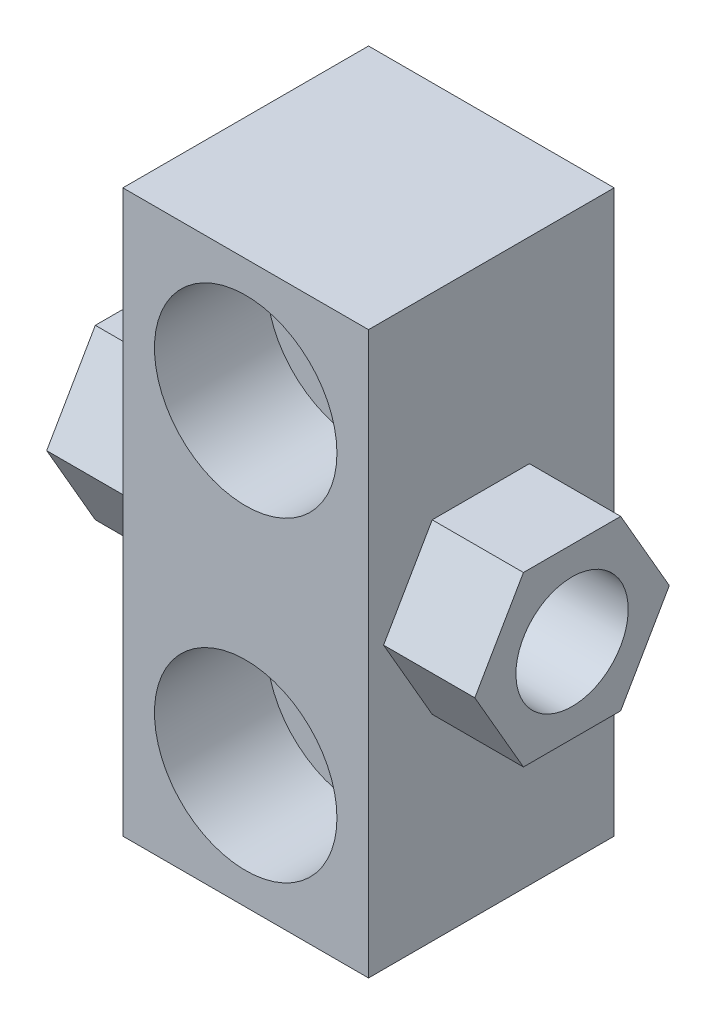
ISO-10303-21;
HEADER;
FILE_DESCRIPTION(('STEP AP214'),'2;1');
FILE_NAME('part.step','',(''),(''),'','','');
FILE_SCHEMA(('AUTOMOTIVE_DESIGN { 1 0 10303 214 1 1 1 1 }'));
ENDSEC;
DATA;
#1=APPLICATION_CONTEXT('core data for automotive mechanical design processes');
#2=APPLICATION_PROTOCOL_DEFINITION('international standard','automotive_design',2000,#1);
#3=PRODUCT_CONTEXT('',#1,'mechanical');
#4=PRODUCT('Part','Part','',(#3));
#5=PRODUCT_RELATED_PRODUCT_CATEGORY('part','',(#4));
#6=PRODUCT_DEFINITION_FORMATION('','',#4);
#7=PRODUCT_DEFINITION_CONTEXT('part definition',#1,'design');
#8=PRODUCT_DEFINITION('design','',#6,#7);
#9=PRODUCT_DEFINITION_SHAPE('','',#8);
#10=(LENGTH_UNIT() NAMED_UNIT(*) SI_UNIT(.MILLI.,.METRE.));
#11=(NAMED_UNIT(*) PLANE_ANGLE_UNIT() SI_UNIT($,.RADIAN.));
#12=(NAMED_UNIT(*) SI_UNIT($,.STERADIAN.) SOLID_ANGLE_UNIT());
#13=UNCERTAINTY_MEASURE_WITH_UNIT(LENGTH_MEASURE(1.E-05),#10,'distance_accuracy_value','');
#14=(GEOMETRIC_REPRESENTATION_CONTEXT(3) GLOBAL_UNCERTAINTY_ASSIGNED_CONTEXT((#13)) GLOBAL_UNIT_ASSIGNED_CONTEXT((#10,
#11,#12)) REPRESENTATION_CONTEXT('',''));
#15=CARTESIAN_POINT('',(0.,0.,0.));
#16=DIRECTION('',(0.,0.,1.));
#17=DIRECTION('',(1.,0.,0.));
#18=AXIS2_PLACEMENT_3D('',#15,#16,#17);
#19=CARTESIAN_POINT('',(0.,0.,36.5));
#20=DIRECTION('',(0.,0.,1.));
#21=DIRECTION('',(1.,0.,0.));
#22=AXIS2_PLACEMENT_3D('',#19,#20,#21);
#23=CYLINDRICAL_SURFACE('',#22,8.5);
#24=CARTESIAN_POINT('',(0.,0.,0.));
#25=DIRECTION('',(0.,0.,-1.));
#26=DIRECTION('',(-1.,0.,0.));
#27=AXIS2_PLACEMENT_3D('',#24,#25,#26);
#28=CIRCLE('',#27,8.5);
#29=CARTESIAN_POINT('',(-8.5,0.,0.));
#30=VERTEX_POINT('',#29);
#31=EDGE_CURVE('E288',#30,#30,#28,.T.);
#32=ORIENTED_EDGE('',*,*,#31,.T.);
#33=EDGE_LOOP('',(#32));
#34=FACE_BOUND('',#33,.T.);
#35=CARTESIAN_POINT('',(0.,0.,19.));
#36=DIRECTION('',(0.,0.,1.));
#37=DIRECTION('',(1.,0.,0.));
#38=AXIS2_PLACEMENT_3D('',#35,#36,#37);
#39=CIRCLE('',#38,8.5);
#40=CARTESIAN_POINT('',(8.5,0.,19.));
#41=VERTEX_POINT('',#40);
#42=EDGE_CURVE('E18',#41,#41,#39,.T.);
#43=ORIENTED_EDGE('',*,*,#42,.T.);
#44=EDGE_LOOP('',(#43));
#45=FACE_BOUND('',#44,.T.);
#46=ADVANCED_FACE('F14',(#34,#45),#23,.F.);
#47=CARTESIAN_POINT('',(0.,45.,36.5));
#48=DIRECTION('',(0.,0.,1.));
#49=DIRECTION('',(1.,0.,0.));
#50=AXIS2_PLACEMENT_3D('',#47,#48,#49);
#51=CYLINDRICAL_SURFACE('',#50,8.5);
#52=CARTESIAN_POINT('',(0.,45.,0.));
#53=DIRECTION('',(0.,0.,-1.));
#54=DIRECTION('',(-1.,0.,0.));
#55=AXIS2_PLACEMENT_3D('',#52,#53,#54);
#56=CIRCLE('',#55,8.5);
#57=CARTESIAN_POINT('',(-8.5,45.,0.));
#58=VERTEX_POINT('',#57);
#59=EDGE_CURVE('E285',#58,#58,#56,.T.);
#60=ORIENTED_EDGE('',*,*,#59,.T.);
#61=EDGE_LOOP('',(#60));
#62=FACE_BOUND('',#61,.T.);
#63=CARTESIAN_POINT('',(0.,45.,19.));
#64=DIRECTION('',(0.,0.,1.));
#65=DIRECTION('',(1.,0.,0.));
#66=AXIS2_PLACEMENT_3D('',#63,#64,#65);
#67=CIRCLE('',#66,8.5);
#68=CARTESIAN_POINT('',(8.5,45.,19.));
#69=VERTEX_POINT('',#68);
#70=EDGE_CURVE('E267',#69,#69,#67,.T.);
#71=ORIENTED_EDGE('',*,*,#70,.T.);
#72=EDGE_LOOP('',(#71));
#73=FACE_BOUND('',#72,.T.);
#74=ADVANCED_FACE('F310',(#62,#73),#51,.F.);
#75=CARTESIAN_POINT('',(-17.5,-17.5,1.5));
#76=DIRECTION('',(1.,0.,0.));
#77=DIRECTION('',(0.,1.,0.));
#78=AXIS2_PLACEMENT_3D('',#75,#76,#77);
#79=PLANE('',#78);
#80=DIRECTION('',(0.,0.866025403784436,0.5));
#81=VECTOR('',#80,1.);
#82=CARTESIAN_POINT('',(-17.5,10.5,25.9282032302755));
#83=LINE('',#82,#81);
#84=CARTESIAN_POINT('',(-17.5,10.5,25.9282032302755));
#85=VERTEX_POINT('',#84);
#86=CARTESIAN_POINT('',(-17.5,22.5,32.8564064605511));
#87=VERTEX_POINT('',#86);
#88=EDGE_CURVE('E39',#85,#87,#83,.T.);
#89=ORIENTED_EDGE('',*,*,#88,.F.);
#90=DIRECTION('',(0.,0.,-1.));
#91=VECTOR('',#90,1.);
#92=CARTESIAN_POINT('',(-17.5,10.5,25.9282032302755));
#93=LINE('',#92,#91);
#94=CARTESIAN_POINT('',(-17.5,10.5,12.0717967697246));
#95=VERTEX_POINT('',#94);
#96=EDGE_CURVE('E163',#85,#95,#93,.T.);
#97=ORIENTED_EDGE('',*,*,#96,.T.);
#98=DIRECTION('',(0.,0.866025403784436,-0.5));
#99=VECTOR('',#98,1.);
#100=CARTESIAN_POINT('',(-17.5,10.5,12.0717967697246));
#101=LINE('',#100,#99);
#102=CARTESIAN_POINT('',(-17.5,22.5,5.14359353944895));
#103=VERTEX_POINT('',#102);
#104=EDGE_CURVE('E166',#95,#103,#101,.T.);
#105=ORIENTED_EDGE('',*,*,#104,.T.);
#106=DIRECTION('',(0.,-0.866025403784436,-0.5));
#107=VECTOR('',#106,1.);
#108=CARTESIAN_POINT('',(-17.5,34.5,12.0717967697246));
#109=LINE('',#108,#107);
#110=CARTESIAN_POINT('',(-17.5,34.5,12.0717967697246));
#111=VERTEX_POINT('',#110);
#112=EDGE_CURVE('E169',#111,#103,#109,.T.);
#113=ORIENTED_EDGE('',*,*,#112,.F.);
#114=DIRECTION('',(0.,0.,-1.));
#115=VECTOR('',#114,1.);
#116=CARTESIAN_POINT('',(-17.5,34.5,25.9282032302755));
#117=LINE('',#116,#115);
#118=CARTESIAN_POINT('',(-17.5,34.5,25.9282032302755));
#119=VERTEX_POINT('',#118);
#120=EDGE_CURVE('E172',#119,#111,#117,.T.);
#121=ORIENTED_EDGE('',*,*,#120,.F.);
#122=DIRECTION('',(0.,-0.866025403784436,0.5));
#123=VECTOR('',#122,1.);
#124=CARTESIAN_POINT('',(-17.5,34.5,25.9282032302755));
#125=LINE('',#124,#123);
#126=EDGE_CURVE('E175',#119,#87,#125,.T.);
#127=ORIENTED_EDGE('',*,*,#126,.T.);
#128=EDGE_LOOP('',(#89,#97,#105,#113,#121,#127));
#129=FACE_BOUND('',#128,.T.);
#130=DIRECTION('',(0.,-1.,0.));
#131=VECTOR('',#130,1.);
#132=CARTESIAN_POINT('',(-17.5,62.5,35.));
#133=LINE('',#132,#131);
#134=CARTESIAN_POINT('',(-17.5,62.5,35.));
#135=VERTEX_POINT('',#134);
#136=CARTESIAN_POINT('',(-17.5,-17.5,35.));
#137=VERTEX_POINT('',#136);
#138=EDGE_CURVE('E127',#135,#137,#133,.T.);
#139=ORIENTED_EDGE('',*,*,#138,.F.);
#140=DIRECTION('',(0.,0.,1.));
#141=VECTOR('',#140,1.);
#142=CARTESIAN_POINT('',(-17.5,62.5,1.5));
#143=LINE('',#142,#141);
#144=CARTESIAN_POINT('',(-17.5,62.5,0.));
#145=VERTEX_POINT('',#144);
#146=EDGE_CURVE('E23',#145,#135,#143,.T.);
#147=ORIENTED_EDGE('',*,*,#146,.F.);
#148=DIRECTION('',(0.,1.,0.));
#149=VECTOR('',#148,1.);
#150=CARTESIAN_POINT('',(-17.5,-17.5,0.));
#151=LINE('',#150,#149);
#152=CARTESIAN_POINT('',(-17.5,-17.5,0.));
#153=VERTEX_POINT('',#152);
#154=EDGE_CURVE('E144',#153,#145,#151,.T.);
#155=ORIENTED_EDGE('',*,*,#154,.F.);
#156=DIRECTION('',(0.,0.,1.));
#157=VECTOR('',#156,1.);
#158=CARTESIAN_POINT('',(-17.5,-17.5,1.5));
#159=LINE('',#158,#157);
#160=EDGE_CURVE('E9',#153,#137,#159,.T.);
#161=ORIENTED_EDGE('',*,*,#160,.T.);
#162=EDGE_LOOP('',(#139,#147,#155,#161));
#163=FACE_BOUND('',#162,.T.);
#164=ADVANCED_FACE('F16',(#129,#163),#79,.F.);
#165=CARTESIAN_POINT('',(-17.5,-17.5,1.5));
#166=DIRECTION('',(0.,-1.,0.));
#167=DIRECTION('',(1.,0.,0.));
#168=AXIS2_PLACEMENT_3D('',#165,#166,#167);
#169=PLANE('',#168);
#170=DIRECTION('',(0.,0.,1.));
#171=VECTOR('',#170,1.);
#172=CARTESIAN_POINT('',(17.5,-17.5,1.5));
#173=LINE('',#172,#171);
#174=CARTESIAN_POINT('',(17.5,-17.5,0.));
#175=VERTEX_POINT('',#174);
#176=CARTESIAN_POINT('',(17.5,-17.5,35.));
#177=VERTEX_POINT('',#176);
#178=EDGE_CURVE('E139',#175,#177,#173,.T.);
#179=ORIENTED_EDGE('',*,*,#178,.T.);
#180=DIRECTION('',(1.,0.,0.));
#181=VECTOR('',#180,1.);
#182=CARTESIAN_POINT('',(-17.5,-17.5,35.));
#183=LINE('',#182,#181);
#184=EDGE_CURVE('E31',#137,#177,#183,.T.);
#185=ORIENTED_EDGE('',*,*,#184,.F.);
#186=ORIENTED_EDGE('',*,*,#160,.F.);
#187=DIRECTION('',(-1.,0.,0.));
#188=VECTOR('',#187,1.);
#189=CARTESIAN_POINT('',(17.5,-17.5,0.));
#190=LINE('',#189,#188);
#191=EDGE_CURVE('E149',#175,#153,#190,.T.);
#192=ORIENTED_EDGE('',*,*,#191,.F.);
#193=EDGE_LOOP('',(#179,#185,#186,#192));
#194=FACE_BOUND('',#193,.T.);
#195=ADVANCED_FACE('F136',(#194),#169,.T.);
#196=CARTESIAN_POINT('',(17.5,62.5,1.5));
#197=DIRECTION('',(0.,1.,0.));
#198=DIRECTION('',(-1.,0.,0.));
#199=AXIS2_PLACEMENT_3D('',#196,#197,#198);
#200=PLANE('',#199);
#201=ORIENTED_EDGE('',*,*,#146,.T.);
#202=DIRECTION('',(-1.,0.,0.));
#203=VECTOR('',#202,1.);
#204=CARTESIAN_POINT('',(17.5,62.5,35.));
#205=LINE('',#204,#203);
#206=CARTESIAN_POINT('',(17.5,62.5,35.));
#207=VERTEX_POINT('',#206);
#208=EDGE_CURVE('E130',#207,#135,#205,.T.);
#209=ORIENTED_EDGE('',*,*,#208,.F.);
#210=DIRECTION('',(0.,0.,1.));
#211=VECTOR('',#210,1.);
#212=CARTESIAN_POINT('',(17.5,62.5,1.5));
#213=LINE('',#212,#211);
#214=CARTESIAN_POINT('',(17.5,62.5,0.));
#215=VERTEX_POINT('',#214);
#216=EDGE_CURVE('E260',#215,#207,#213,.T.);
#217=ORIENTED_EDGE('',*,*,#216,.F.);
#218=DIRECTION('',(1.,0.,0.));
#219=VECTOR('',#218,1.);
#220=CARTESIAN_POINT('',(-17.5,62.5,0.));
#221=LINE('',#220,#219);
#222=EDGE_CURVE('E148',#145,#215,#221,.T.);
#223=ORIENTED_EDGE('',*,*,#222,.F.);
#224=EDGE_LOOP('',(#201,#209,#217,#223));
#225=FACE_BOUND('',#224,.T.);
#226=ADVANCED_FACE('F297',(#225),#200,.T.);
#227=CARTESIAN_POINT('',(17.5,62.5,1.5));
#228=DIRECTION('',(-1.,0.,0.));
#229=DIRECTION('',(0.,-1.,0.));
#230=AXIS2_PLACEMENT_3D('',#227,#228,#229);
#231=PLANE('',#230);
#232=DIRECTION('',(0.,0.,-1.));
#233=VECTOR('',#232,1.);
#234=CARTESIAN_POINT('',(17.5,10.5,25.9282032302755));
#235=LINE('',#234,#233);
#236=CARTESIAN_POINT('',(17.5,10.5,25.9282032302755));
#237=VERTEX_POINT('',#236);
#238=CARTESIAN_POINT('',(17.5,10.5,12.0717967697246));
#239=VERTEX_POINT('',#238);
#240=EDGE_CURVE('E220',#237,#239,#235,.T.);
#241=ORIENTED_EDGE('',*,*,#240,.F.);
#242=DIRECTION('',(0.,0.866025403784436,0.5));
#243=VECTOR('',#242,1.);
#244=CARTESIAN_POINT('',(17.5,10.5,25.9282032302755));
#245=LINE('',#244,#243);
#246=CARTESIAN_POINT('',(17.5,22.5,32.8564064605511));
#247=VERTEX_POINT('',#246);
#248=EDGE_CURVE('E208',#237,#247,#245,.T.);
#249=ORIENTED_EDGE('',*,*,#248,.T.);
#250=DIRECTION('',(0.,-0.866025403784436,0.5));
#251=VECTOR('',#250,1.);
#252=CARTESIAN_POINT('',(17.5,34.5,25.9282032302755));
#253=LINE('',#252,#251);
#254=CARTESIAN_POINT('',(17.5,34.5,25.9282032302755));
#255=VERTEX_POINT('',#254);
#256=EDGE_CURVE('E210',#255,#247,#253,.T.);
#257=ORIENTED_EDGE('',*,*,#256,.F.);
#258=DIRECTION('',(0.,0.,-1.));
#259=VECTOR('',#258,1.);
#260=CARTESIAN_POINT('',(17.5,34.5,25.9282032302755));
#261=LINE('',#260,#259);
#262=CARTESIAN_POINT('',(17.5,34.5,12.0717967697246));
#263=VERTEX_POINT('',#262);
#264=EDGE_CURVE('E213',#255,#263,#261,.T.);
#265=ORIENTED_EDGE('',*,*,#264,.T.);
#266=DIRECTION('',(0.,-0.866025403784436,-0.5));
#267=VECTOR('',#266,1.);
#268=CARTESIAN_POINT('',(17.5,34.5,12.0717967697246));
#269=LINE('',#268,#267);
#270=CARTESIAN_POINT('',(17.5,22.5,5.14359353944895));
#271=VERTEX_POINT('',#270);
#272=EDGE_CURVE('E215',#263,#271,#269,.T.);
#273=ORIENTED_EDGE('',*,*,#272,.T.);
#274=DIRECTION('',(0.,0.866025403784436,-0.5));
#275=VECTOR('',#274,1.);
#276=CARTESIAN_POINT('',(17.5,10.5,12.0717967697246));
#277=LINE('',#276,#275);
#278=EDGE_CURVE('E217',#239,#271,#277,.T.);
#279=ORIENTED_EDGE('',*,*,#278,.F.);
#280=EDGE_LOOP('',(#241,#249,#257,#265,#273,#279));
#281=FACE_BOUND('',#280,.T.);
#282=DIRECTION('',(0.,1.,0.));
#283=VECTOR('',#282,1.);
#284=CARTESIAN_POINT('',(17.5,-17.5,35.));
#285=LINE('',#284,#283);
#286=EDGE_CURVE('E140',#177,#207,#285,.T.);
#287=ORIENTED_EDGE('',*,*,#286,.F.);
#288=ORIENTED_EDGE('',*,*,#178,.F.);
#289=DIRECTION('',(0.,-1.,0.));
#290=VECTOR('',#289,1.);
#291=CARTESIAN_POINT('',(17.5,62.5,0.));
#292=LINE('',#291,#290);
#293=EDGE_CURVE('E153',#215,#175,#292,.T.);
#294=ORIENTED_EDGE('',*,*,#293,.F.);
#295=ORIENTED_EDGE('',*,*,#216,.T.);
#296=EDGE_LOOP('',(#287,#288,#294,#295));
#297=FACE_BOUND('',#296,.T.);
#298=ADVANCED_FACE('F295',(#281,#297),#231,.F.);
#299=CARTESIAN_POINT('',(0.,0.,36.5));
#300=DIRECTION('',(0.,0.,1.));
#301=DIRECTION('',(1.,0.,0.));
#302=AXIS2_PLACEMENT_3D('',#299,#300,#301);
#303=CYLINDRICAL_SURFACE('',#302,13.);
#304=CARTESIAN_POINT('',(0.,0.,35.));
#305=DIRECTION('',(0.,0.,1.));
#306=DIRECTION('',(1.,0.,0.));
#307=AXIS2_PLACEMENT_3D('',#304,#305,#306);
#308=CIRCLE('',#307,13.);
#309=CARTESIAN_POINT('',(13.,0.,35.));
#310=VERTEX_POINT('',#309);
#311=EDGE_CURVE('E266',#310,#310,#308,.T.);
#312=ORIENTED_EDGE('',*,*,#311,.T.);
#313=EDGE_LOOP('',(#312));
#314=FACE_BOUND('',#313,.T.);
#315=CARTESIAN_POINT('',(0.,0.,19.));
#316=DIRECTION('',(0.,0.,1.));
#317=DIRECTION('',(1.,0.,0.));
#318=AXIS2_PLACEMENT_3D('',#315,#316,#317);
#319=CIRCLE('',#318,13.);
#320=CARTESIAN_POINT('',(13.,0.,19.));
#321=VERTEX_POINT('',#320);
#322=EDGE_CURVE('E269',#321,#321,#319,.T.);
#323=ORIENTED_EDGE('',*,*,#322,.F.);
#324=EDGE_LOOP('',(#323));
#325=FACE_BOUND('',#324,.T.);
#326=ADVANCED_FACE('F305',(#314,#325),#303,.F.);
#327=CARTESIAN_POINT('',(0.,45.,36.5));
#328=DIRECTION('',(0.,0.,1.));
#329=DIRECTION('',(1.,0.,0.));
#330=AXIS2_PLACEMENT_3D('',#327,#328,#329);
#331=CYLINDRICAL_SURFACE('',#330,13.);
#332=CARTESIAN_POINT('',(0.,45.,35.));
#333=DIRECTION('',(0.,0.,1.));
#334=DIRECTION('',(1.,0.,0.));
#335=AXIS2_PLACEMENT_3D('',#332,#333,#334);
#336=CIRCLE('',#335,13.);
#337=CARTESIAN_POINT('',(13.,45.,35.));
#338=VERTEX_POINT('',#337);
#339=EDGE_CURVE('E264',#338,#338,#336,.T.);
#340=ORIENTED_EDGE('',*,*,#339,.T.);
#341=EDGE_LOOP('',(#340));
#342=FACE_BOUND('',#341,.T.);
#343=CARTESIAN_POINT('',(0.,45.,19.));
#344=DIRECTION('',(0.,0.,1.));
#345=DIRECTION('',(1.,0.,0.));
#346=AXIS2_PLACEMENT_3D('',#343,#344,#345);
#347=CIRCLE('',#346,13.);
#348=CARTESIAN_POINT('',(13.,45.,19.));
#349=VERTEX_POINT('',#348);
#350=EDGE_CURVE('E274',#349,#349,#347,.T.);
#351=ORIENTED_EDGE('',*,*,#350,.F.);
#352=EDGE_LOOP('',(#351));
#353=FACE_BOUND('',#352,.T.);
#354=ADVANCED_FACE('F322',(#342,#353),#331,.F.);
#355=CARTESIAN_POINT('',(30.5,10.5,25.9282032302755));
#356=DIRECTION('',(0.,-0.5,0.866025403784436));
#357=DIRECTION('',(0.,-0.866025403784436,-0.5));
#358=AXIS2_PLACEMENT_3D('',#355,#356,#357);
#359=PLANE('',#358);
#360=DIRECTION('',(-1.,0.,0.));
#361=VECTOR('',#360,1.);
#362=CARTESIAN_POINT('',(30.5,10.5,25.9282032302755));
#363=LINE('',#362,#361);
#364=CARTESIAN_POINT('',(30.5,10.5,25.9282032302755));
#365=VERTEX_POINT('',#364);
#366=EDGE_CURVE('E256',#365,#237,#363,.T.);
#367=ORIENTED_EDGE('',*,*,#366,.F.);
#368=DIRECTION('',(0.,0.866025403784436,0.5));
#369=VECTOR('',#368,1.);
#370=CARTESIAN_POINT('',(30.5,10.5,25.9282032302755));
#371=LINE('',#370,#369);
#372=CARTESIAN_POINT('',(30.5,22.5,32.8564064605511));
#373=VERTEX_POINT('',#372);
#374=EDGE_CURVE('E223',#365,#373,#371,.T.);
#375=ORIENTED_EDGE('',*,*,#374,.T.);
#376=DIRECTION('',(-1.,0.,0.));
#377=VECTOR('',#376,1.);
#378=CARTESIAN_POINT('',(30.5,22.5,32.8564064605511));
#379=LINE('',#378,#377);
#380=EDGE_CURVE('E241',#373,#247,#379,.T.);
#381=ORIENTED_EDGE('',*,*,#380,.T.);
#382=ORIENTED_EDGE('',*,*,#248,.F.);
#383=EDGE_LOOP('',(#367,#375,#381,#382));
#384=FACE_BOUND('',#383,.T.);
#385=ADVANCED_FACE('F327',(#384),#359,.T.);
#386=CARTESIAN_POINT('',(30.5,10.5,25.9282032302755));
#387=DIRECTION('',(0.,1.,0.));
#388=DIRECTION('',(-1.,0.,0.));
#389=AXIS2_PLACEMENT_3D('',#386,#387,#388);
#390=PLANE('',#389);
#391=DIRECTION('',(-1.,0.,0.));
#392=VECTOR('',#391,1.);
#393=CARTESIAN_POINT('',(30.5,10.5,12.0717967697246));
#394=LINE('',#393,#392);
#395=CARTESIAN_POINT('',(30.5,10.5,12.0717967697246));
#396=VERTEX_POINT('',#395);
#397=EDGE_CURVE('E253',#396,#239,#394,.T.);
#398=ORIENTED_EDGE('',*,*,#397,.F.);
#399=DIRECTION('',(0.,0.,-1.));
#400=VECTOR('',#399,1.);
#401=CARTESIAN_POINT('',(30.5,10.5,25.9282032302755));
#402=LINE('',#401,#400);
#403=EDGE_CURVE('E238',#365,#396,#402,.T.);
#404=ORIENTED_EDGE('',*,*,#403,.F.);
#405=ORIENTED_EDGE('',*,*,#366,.T.);
#406=ORIENTED_EDGE('',*,*,#240,.T.);
#407=EDGE_LOOP('',(#398,#404,#405,#406));
#408=FACE_BOUND('',#407,.T.);
#409=ADVANCED_FACE('F329',(#408),#390,.F.);
#410=CARTESIAN_POINT('',(30.5,10.5,12.0717967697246));
#411=DIRECTION('',(0.,0.5,0.866025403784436));
#412=DIRECTION('',(0.,-0.866025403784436,0.5));
#413=AXIS2_PLACEMENT_3D('',#410,#411,#412);
#414=PLANE('',#413);
#415=DIRECTION('',(-1.,0.,0.));
#416=VECTOR('',#415,1.);
#417=CARTESIAN_POINT('',(30.5,22.5,5.14359353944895));
#418=LINE('',#417,#416);
#419=CARTESIAN_POINT('',(30.5,22.5,5.14359353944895));
#420=VERTEX_POINT('',#419);
#421=EDGE_CURVE('E250',#420,#271,#418,.T.);
#422=ORIENTED_EDGE('',*,*,#421,.F.);
#423=DIRECTION('',(0.,0.866025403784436,-0.5));
#424=VECTOR('',#423,1.);
#425=CARTESIAN_POINT('',(30.5,10.5,12.0717967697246));
#426=LINE('',#425,#424);
#427=EDGE_CURVE('E235',#396,#420,#426,.T.);
#428=ORIENTED_EDGE('',*,*,#427,.F.);
#429=ORIENTED_EDGE('',*,*,#397,.T.);
#430=ORIENTED_EDGE('',*,*,#278,.T.);
#431=EDGE_LOOP('',(#422,#428,#429,#430));
#432=FACE_BOUND('',#431,.T.);
#433=ADVANCED_FACE('F332',(#432),#414,.F.);
#434=CARTESIAN_POINT('',(30.5,34.5,12.0717967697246));
#435=DIRECTION('',(0.,0.5,-0.866025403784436));
#436=DIRECTION('',(0.,0.866025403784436,0.5));
#437=AXIS2_PLACEMENT_3D('',#434,#435,#436);
#438=PLANE('',#437);
#439=DIRECTION('',(-1.,0.,0.));
#440=VECTOR('',#439,1.);
#441=CARTESIAN_POINT('',(30.5,34.5,12.0717967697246));
#442=LINE('',#441,#440);
#443=CARTESIAN_POINT('',(30.5,34.5,12.0717967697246));
#444=VERTEX_POINT('',#443);
#445=EDGE_CURVE('E247',#444,#263,#442,.T.);
#446=ORIENTED_EDGE('',*,*,#445,.F.);
#447=DIRECTION('',(0.,-0.866025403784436,-0.5));
#448=VECTOR('',#447,1.);
#449=CARTESIAN_POINT('',(30.5,34.5,12.0717967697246));
#450=LINE('',#449,#448);
#451=EDGE_CURVE('E232',#444,#420,#450,.T.);
#452=ORIENTED_EDGE('',*,*,#451,.T.);
#453=ORIENTED_EDGE('',*,*,#421,.T.);
#454=ORIENTED_EDGE('',*,*,#272,.F.);
#455=EDGE_LOOP('',(#446,#452,#453,#454));
#456=FACE_BOUND('',#455,.T.);
#457=ADVANCED_FACE('F336',(#456),#438,.T.);
#458=CARTESIAN_POINT('',(30.5,34.5,25.9282032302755));
#459=DIRECTION('',(0.,1.,0.));
#460=DIRECTION('',(-1.,0.,0.));
#461=AXIS2_PLACEMENT_3D('',#458,#459,#460);
#462=PLANE('',#461);
#463=DIRECTION('',(-1.,0.,0.));
#464=VECTOR('',#463,1.);
#465=CARTESIAN_POINT('',(30.5,34.5,25.9282032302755));
#466=LINE('',#465,#464);
#467=CARTESIAN_POINT('',(30.5,34.5,25.9282032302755));
#468=VERTEX_POINT('',#467);
#469=EDGE_CURVE('E244',#468,#255,#466,.T.);
#470=ORIENTED_EDGE('',*,*,#469,.F.);
#471=DIRECTION('',(0.,0.,-1.));
#472=VECTOR('',#471,1.);
#473=CARTESIAN_POINT('',(30.5,34.5,25.9282032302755));
#474=LINE('',#473,#472);
#475=EDGE_CURVE('E229',#468,#444,#474,.T.);
#476=ORIENTED_EDGE('',*,*,#475,.T.);
#477=ORIENTED_EDGE('',*,*,#445,.T.);
#478=ORIENTED_EDGE('',*,*,#264,.F.);
#479=EDGE_LOOP('',(#470,#476,#477,#478));
#480=FACE_BOUND('',#479,.T.);
#481=ADVANCED_FACE('F340',(#480),#462,.T.);
#482=CARTESIAN_POINT('',(30.5,34.5,25.9282032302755));
#483=DIRECTION('',(0.,-0.5,-0.866025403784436));
#484=DIRECTION('',(0.,0.866025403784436,-0.5));
#485=AXIS2_PLACEMENT_3D('',#482,#483,#484);
#486=PLANE('',#485);
#487=DIRECTION('',(0.,-0.866025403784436,0.5));
#488=VECTOR('',#487,1.);
#489=CARTESIAN_POINT('',(30.5,34.5,25.9282032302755));
#490=LINE('',#489,#488);
#491=EDGE_CURVE('E226',#468,#373,#490,.T.);
#492=ORIENTED_EDGE('',*,*,#491,.F.);
#493=ORIENTED_EDGE('',*,*,#469,.T.);
#494=ORIENTED_EDGE('',*,*,#256,.T.);
#495=ORIENTED_EDGE('',*,*,#380,.F.);
#496=EDGE_LOOP('',(#492,#493,#494,#495));
#497=FACE_BOUND('',#496,.T.);
#498=ADVANCED_FACE('F344',(#497),#486,.F.);
#499=CARTESIAN_POINT('',(30.5,22.5,32.8564064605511));
#500=DIRECTION('',(1.,0.,0.));
#501=DIRECTION('',(0.,1.,0.));
#502=AXIS2_PLACEMENT_3D('',#499,#500,#501);
#503=PLANE('',#502);
#504=CARTESIAN_POINT('',(30.5,22.5,19.));
#505=DIRECTION('',(1.,0.,0.));
#506=DIRECTION('',(0.,1.,0.));
#507=AXIS2_PLACEMENT_3D('',#504,#505,#506);
#508=CIRCLE('',#507,8.);
#509=CARTESIAN_POINT('',(30.5,30.5,19.));
#510=VERTEX_POINT('',#509);
#511=EDGE_CURVE('E151',#510,#510,#508,.T.);
#512=ORIENTED_EDGE('',*,*,#511,.F.);
#513=EDGE_LOOP('',(#512));
#514=FACE_BOUND('',#513,.T.);
#515=ORIENTED_EDGE('',*,*,#374,.F.);
#516=ORIENTED_EDGE('',*,*,#403,.T.);
#517=ORIENTED_EDGE('',*,*,#427,.T.);
#518=ORIENTED_EDGE('',*,*,#451,.F.);
#519=ORIENTED_EDGE('',*,*,#475,.F.);
#520=ORIENTED_EDGE('',*,*,#491,.T.);
#521=EDGE_LOOP('',(#515,#516,#517,#518,#519,#520));
#522=FACE_BOUND('',#521,.T.);
#523=ADVANCED_FACE('F346',(#514,#522),#503,.T.);
#524=CARTESIAN_POINT('',(-30.5,10.5,25.9282032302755));
#525=DIRECTION('',(0.,0.5,-0.866025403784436));
#526=DIRECTION('',(0.,0.866025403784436,0.5));
#527=AXIS2_PLACEMENT_3D('',#524,#525,#526);
#528=PLANE('',#527);
#529=DIRECTION('',(1.,0.,0.));
#530=VECTOR('',#529,1.);
#531=CARTESIAN_POINT('',(-30.5,22.5,32.8564064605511));
#532=LINE('',#531,#530);
#533=CARTESIAN_POINT('',(-30.5,22.5,32.8564064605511));
#534=VERTEX_POINT('',#533);
#535=EDGE_CURVE('E206',#534,#87,#532,.T.);
#536=ORIENTED_EDGE('',*,*,#535,.F.);
#537=DIRECTION('',(0.,0.866025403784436,0.5));
#538=VECTOR('',#537,1.);
#539=CARTESIAN_POINT('',(-30.5,10.5,25.9282032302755));
#540=LINE('',#539,#538);
#541=CARTESIAN_POINT('',(-30.5,10.5,25.9282032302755));
#542=VERTEX_POINT('',#541);
#543=EDGE_CURVE('E178',#542,#534,#540,.T.);
#544=ORIENTED_EDGE('',*,*,#543,.F.);
#545=DIRECTION('',(1.,0.,0.));
#546=VECTOR('',#545,1.);
#547=CARTESIAN_POINT('',(-30.5,10.5,25.9282032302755));
#548=LINE('',#547,#546);
#549=EDGE_CURVE('E196',#542,#85,#548,.T.);
#550=ORIENTED_EDGE('',*,*,#549,.T.);
#551=ORIENTED_EDGE('',*,*,#88,.T.);
#552=EDGE_LOOP('',(#536,#544,#550,#551));
#553=FACE_BOUND('',#552,.T.);
#554=ADVANCED_FACE('F350',(#553),#528,.F.);
#555=CARTESIAN_POINT('',(-30.5,34.5,25.9282032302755));
#556=DIRECTION('',(0.,0.5,0.866025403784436));
#557=DIRECTION('',(0.,-0.866025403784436,0.5));
#558=AXIS2_PLACEMENT_3D('',#555,#556,#557);
#559=PLANE('',#558);
#560=DIRECTION('',(1.,0.,0.));
#561=VECTOR('',#560,1.);
#562=CARTESIAN_POINT('',(-30.5,34.5,25.9282032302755));
#563=LINE('',#562,#561);
#564=CARTESIAN_POINT('',(-30.5,34.5,25.9282032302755));
#565=VERTEX_POINT('',#564);
#566=EDGE_CURVE('E204',#565,#119,#563,.T.);
#567=ORIENTED_EDGE('',*,*,#566,.F.);
#568=DIRECTION('',(0.,-0.866025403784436,0.5));
#569=VECTOR('',#568,1.);
#570=CARTESIAN_POINT('',(-30.5,34.5,25.9282032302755));
#571=LINE('',#570,#569);
#572=EDGE_CURVE('E193',#565,#534,#571,.T.);
#573=ORIENTED_EDGE('',*,*,#572,.T.);
#574=ORIENTED_EDGE('',*,*,#535,.T.);
#575=ORIENTED_EDGE('',*,*,#126,.F.);
#576=EDGE_LOOP('',(#567,#573,#574,#575));
#577=FACE_BOUND('',#576,.T.);
#578=ADVANCED_FACE('F357',(#577),#559,.T.);
#579=CARTESIAN_POINT('',(-30.5,34.5,25.9282032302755));
#580=DIRECTION('',(0.,-1.,0.));
#581=DIRECTION('',(1.,0.,0.));
#582=AXIS2_PLACEMENT_3D('',#579,#580,#581);
#583=PLANE('',#582);
#584=DIRECTION('',(1.,0.,0.));
#585=VECTOR('',#584,1.);
#586=CARTESIAN_POINT('',(-30.5,34.5,12.0717967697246));
#587=LINE('',#586,#585);
#588=CARTESIAN_POINT('',(-30.5,34.5,12.0717967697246));
#589=VERTEX_POINT('',#588);
#590=EDGE_CURVE('E202',#589,#111,#587,.T.);
#591=ORIENTED_EDGE('',*,*,#590,.F.);
#592=DIRECTION('',(0.,0.,-1.));
#593=VECTOR('',#592,1.);
#594=CARTESIAN_POINT('',(-30.5,34.5,25.9282032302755));
#595=LINE('',#594,#593);
#596=EDGE_CURVE('E190',#565,#589,#595,.T.);
#597=ORIENTED_EDGE('',*,*,#596,.F.);
#598=ORIENTED_EDGE('',*,*,#566,.T.);
#599=ORIENTED_EDGE('',*,*,#120,.T.);
#600=EDGE_LOOP('',(#591,#597,#598,#599));
#601=FACE_BOUND('',#600,.T.);
#602=ADVANCED_FACE('F360',(#601),#583,.F.);
#603=CARTESIAN_POINT('',(-30.5,34.5,12.0717967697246));
#604=DIRECTION('',(0.,-0.5,0.866025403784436));
#605=DIRECTION('',(0.,-0.866025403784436,-0.5));
#606=AXIS2_PLACEMENT_3D('',#603,#604,#605);
#607=PLANE('',#606);
#608=DIRECTION('',(1.,0.,0.));
#609=VECTOR('',#608,1.);
#610=CARTESIAN_POINT('',(-30.5,22.5,5.14359353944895));
#611=LINE('',#610,#609);
#612=CARTESIAN_POINT('',(-30.5,22.5,5.14359353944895));
#613=VERTEX_POINT('',#612);
#614=EDGE_CURVE('E200',#613,#103,#611,.T.);
#615=ORIENTED_EDGE('',*,*,#614,.F.);
#616=DIRECTION('',(0.,-0.866025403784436,-0.5));
#617=VECTOR('',#616,1.);
#618=CARTESIAN_POINT('',(-30.5,34.5,12.0717967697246));
#619=LINE('',#618,#617);
#620=EDGE_CURVE('E187',#589,#613,#619,.T.);
#621=ORIENTED_EDGE('',*,*,#620,.F.);
#622=ORIENTED_EDGE('',*,*,#590,.T.);
#623=ORIENTED_EDGE('',*,*,#112,.T.);
#624=EDGE_LOOP('',(#615,#621,#622,#623));
#625=FACE_BOUND('',#624,.T.);
#626=ADVANCED_FACE('F364',(#625),#607,.F.);
#627=CARTESIAN_POINT('',(-30.5,10.5,12.0717967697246));
#628=DIRECTION('',(0.,-0.5,-0.866025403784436));
#629=DIRECTION('',(0.,0.866025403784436,-0.5));
#630=AXIS2_PLACEMENT_3D('',#627,#628,#629);
#631=PLANE('',#630);
#632=DIRECTION('',(1.,0.,0.));
#633=VECTOR('',#632,1.);
#634=CARTESIAN_POINT('',(-30.5,10.5,12.0717967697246));
#635=LINE('',#634,#633);
#636=CARTESIAN_POINT('',(-30.5,10.5,12.0717967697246));
#637=VERTEX_POINT('',#636);
#638=EDGE_CURVE('E198',#637,#95,#635,.T.);
#639=ORIENTED_EDGE('',*,*,#638,.F.);
#640=DIRECTION('',(0.,0.866025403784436,-0.5));
#641=VECTOR('',#640,1.);
#642=CARTESIAN_POINT('',(-30.5,10.5,12.0717967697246));
#643=LINE('',#642,#641);
#644=EDGE_CURVE('E184',#637,#613,#643,.T.);
#645=ORIENTED_EDGE('',*,*,#644,.T.);
#646=ORIENTED_EDGE('',*,*,#614,.T.);
#647=ORIENTED_EDGE('',*,*,#104,.F.);
#648=EDGE_LOOP('',(#639,#645,#646,#647));
#649=FACE_BOUND('',#648,.T.);
#650=ADVANCED_FACE('F368',(#649),#631,.T.);
#651=CARTESIAN_POINT('',(-30.5,10.5,25.9282032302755));
#652=DIRECTION('',(0.,-1.,0.));
#653=DIRECTION('',(1.,0.,0.));
#654=AXIS2_PLACEMENT_3D('',#651,#652,#653);
#655=PLANE('',#654);
#656=DIRECTION('',(0.,0.,-1.));
#657=VECTOR('',#656,1.);
#658=CARTESIAN_POINT('',(-30.5,10.5,25.9282032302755));
#659=LINE('',#658,#657);
#660=EDGE_CURVE('E181',#542,#637,#659,.T.);
#661=ORIENTED_EDGE('',*,*,#660,.T.);
#662=ORIENTED_EDGE('',*,*,#638,.T.);
#663=ORIENTED_EDGE('',*,*,#96,.F.);
#664=ORIENTED_EDGE('',*,*,#549,.F.);
#665=EDGE_LOOP('',(#661,#662,#663,#664));
#666=FACE_BOUND('',#665,.T.);
#667=ADVANCED_FACE('F372',(#666),#655,.T.);
#668=CARTESIAN_POINT('',(-30.5,22.5,32.8564064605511));
#669=DIRECTION('',(-1.,0.,0.));
#670=DIRECTION('',(0.,1.,0.));
#671=AXIS2_PLACEMENT_3D('',#668,#669,#670);
#672=PLANE('',#671);
#673=CARTESIAN_POINT('',(-30.5,22.5,19.));
#674=DIRECTION('',(1.,0.,0.));
#675=DIRECTION('',(0.,1.,0.));
#676=AXIS2_PLACEMENT_3D('',#673,#674,#675);
#677=CIRCLE('',#676,8.);
#678=CARTESIAN_POINT('',(-30.5,30.5,19.));
#679=VERTEX_POINT('',#678);
#680=EDGE_CURVE('E159',#679,#679,#677,.T.);
#681=ORIENTED_EDGE('',*,*,#680,.T.);
#682=EDGE_LOOP('',(#681));
#683=FACE_BOUND('',#682,.T.);
#684=ORIENTED_EDGE('',*,*,#543,.T.);
#685=ORIENTED_EDGE('',*,*,#572,.F.);
#686=ORIENTED_EDGE('',*,*,#596,.T.);
#687=ORIENTED_EDGE('',*,*,#620,.T.);
#688=ORIENTED_EDGE('',*,*,#644,.F.);
#689=ORIENTED_EDGE('',*,*,#660,.F.);
#690=EDGE_LOOP('',(#684,#685,#686,#687,#688,#689));
#691=FACE_BOUND('',#690,.T.);
#692=ADVANCED_FACE('F374',(#683,#691),#672,.T.);
#693=CARTESIAN_POINT('',(-30.5,22.5,19.));
#694=DIRECTION('',(1.,0.,0.));
#695=DIRECTION('',(0.,1.,0.));
#696=AXIS2_PLACEMENT_3D('',#693,#694,#695);
#697=CYLINDRICAL_SURFACE('',#696,8.);
#698=ORIENTED_EDGE('',*,*,#680,.F.);
#699=EDGE_LOOP('',(#698));
#700=FACE_BOUND('',#699,.T.);
#701=ORIENTED_EDGE('',*,*,#511,.T.);
#702=EDGE_LOOP('',(#701));
#703=FACE_BOUND('',#702,.T.);
#704=ADVANCED_FACE('F378',(#700,#703),#697,.F.);
#705=CARTESIAN_POINT('',(0.,22.5,0.));
#706=DIRECTION('',(0.,0.,-1.));
#707=DIRECTION('',(-1.,0.,0.));
#708=AXIS2_PLACEMENT_3D('',#705,#706,#707);
#709=PLANE('',#708);
#710=ORIENTED_EDGE('',*,*,#31,.F.);
#711=EDGE_LOOP('',(#710));
#712=FACE_BOUND('',#711,.T.);
#713=ORIENTED_EDGE('',*,*,#293,.T.);
#714=ORIENTED_EDGE('',*,*,#191,.T.);
#715=ORIENTED_EDGE('',*,*,#154,.T.);
#716=ORIENTED_EDGE('',*,*,#222,.T.);
#717=EDGE_LOOP('',(#713,#714,#715,#716));
#718=FACE_BOUND('',#717,.T.);
#719=ORIENTED_EDGE('',*,*,#59,.F.);
#720=EDGE_LOOP('',(#719));
#721=FACE_BOUND('',#720,.T.);
#722=ADVANCED_FACE('F292',(#712,#718,#721),#709,.T.);
#723=CARTESIAN_POINT('',(0.,22.5,35.));
#724=DIRECTION('',(0.,0.,1.));
#725=DIRECTION('',(1.,0.,0.));
#726=AXIS2_PLACEMENT_3D('',#723,#724,#725);
#727=PLANE('',#726);
#728=ORIENTED_EDGE('',*,*,#311,.F.);
#729=EDGE_LOOP('',(#728));
#730=FACE_BOUND('',#729,.T.);
#731=ORIENTED_EDGE('',*,*,#339,.F.);
#732=EDGE_LOOP('',(#731));
#733=FACE_BOUND('',#732,.T.);
#734=ORIENTED_EDGE('',*,*,#138,.T.);
#735=ORIENTED_EDGE('',*,*,#184,.T.);
#736=ORIENTED_EDGE('',*,*,#286,.T.);
#737=ORIENTED_EDGE('',*,*,#208,.T.);
#738=EDGE_LOOP('',(#734,#735,#736,#737));
#739=FACE_BOUND('',#738,.T.);
#740=ADVANCED_FACE('F128',(#730,#733,#739),#727,.T.);
#741=CARTESIAN_POINT('',(0.,45.,19.));
#742=DIRECTION('',(0.,0.,1.));
#743=DIRECTION('',(1.,0.,0.));
#744=AXIS2_PLACEMENT_3D('',#741,#742,#743);
#745=PLANE('',#744);
#746=ORIENTED_EDGE('',*,*,#70,.F.);
#747=EDGE_LOOP('',(#746));
#748=FACE_BOUND('',#747,.T.);
#749=ORIENTED_EDGE('',*,*,#350,.T.);
#750=EDGE_LOOP('',(#749));
#751=FACE_BOUND('',#750,.T.);
#752=ADVANCED_FACE('F392',(#748,#751),#745,.T.);
#753=CARTESIAN_POINT('',(0.,0.,19.));
#754=DIRECTION('',(0.,0.,1.));
#755=DIRECTION('',(1.,0.,0.));
#756=AXIS2_PLACEMENT_3D('',#753,#754,#755);
#757=PLANE('',#756);
#758=ORIENTED_EDGE('',*,*,#42,.F.);
#759=EDGE_LOOP('',(#758));
#760=FACE_BOUND('',#759,.T.);
#761=ORIENTED_EDGE('',*,*,#322,.T.);
#762=EDGE_LOOP('',(#761));
#763=FACE_BOUND('',#762,.T.);
#764=ADVANCED_FACE('F396',(#760,#763),#757,.T.);
#765=CLOSED_SHELL('',(#46,#74,#164,#195,#226,#298,#326,#354,#385,#409,#433,#457,#481,#498,#523,
#554,#578,#602,#626,#650,#667,#692,#704,#722,#740,#752,#764));
#766=MANIFOLD_SOLID_BREP('B1',#765);
#767=ADVANCED_BREP_SHAPE_REPRESENTATION('',(#18,#766),#14);
#768=SHAPE_DEFINITION_REPRESENTATION(#9,#767);
ENDSEC;
END-ISO-10303-21;
